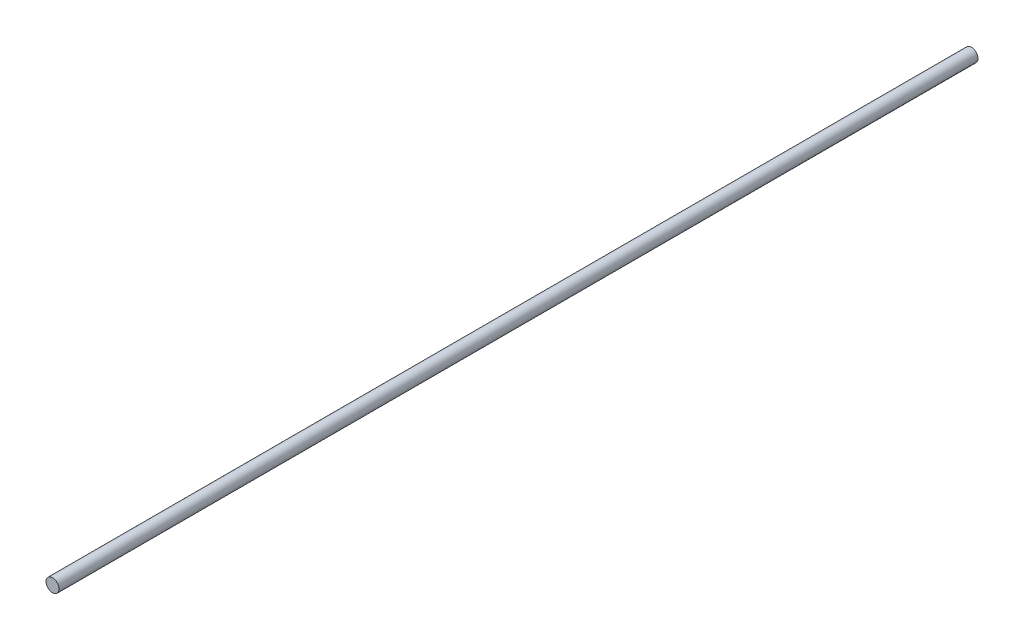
from build123d import *

# Parameters (mm, degrees)
SKETCH1_R      = 1
EXTRUDE1_DEPTH = 140.5


with BuildPart() as part:
    # Sketch1 → Extrude1 (new body)
    with BuildSketch(Plane.XY):
        Circle(SKETCH1_R)
    extrude(amount=EXTRUDE1_DEPTH)


solid = part.part
